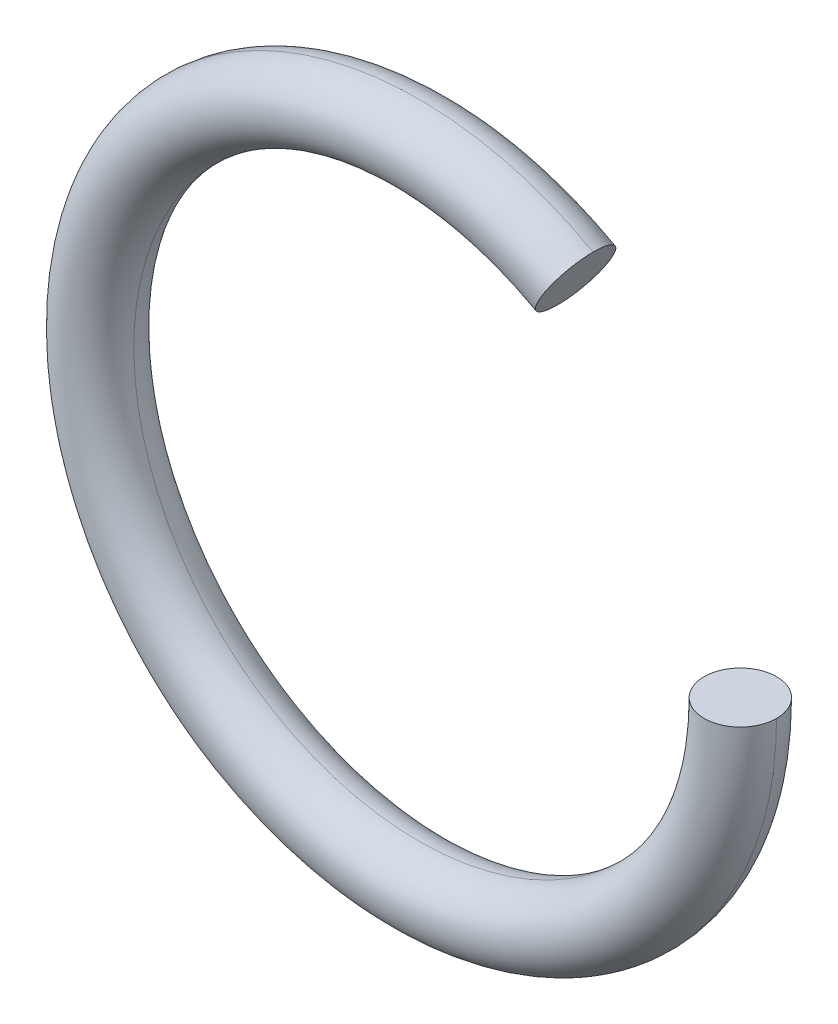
from build123d import *

# Parameters (mm, degrees)
SKETCH2_R = 0.4


with BuildPart() as part:
    # Sweep1: sweep along a path in Sketch1
    with BuildLine(Plane.XY) as sweep1_path:
        ThreePointArc((1.924683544, 3.449361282), (-3.406244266, -2), (3.95, 0))
    # Sketch2 → Sweep1 (sweep)
    with BuildSketch(Plane(origin=(0, 0, 0), x_dir=(1, 0, 0), z_dir=(0, 1, 0))):
        with Locations((3.55, 0)):
            Circle(SKETCH2_R)
    sweep(path=sweep1_path.line)


solid = part.part
